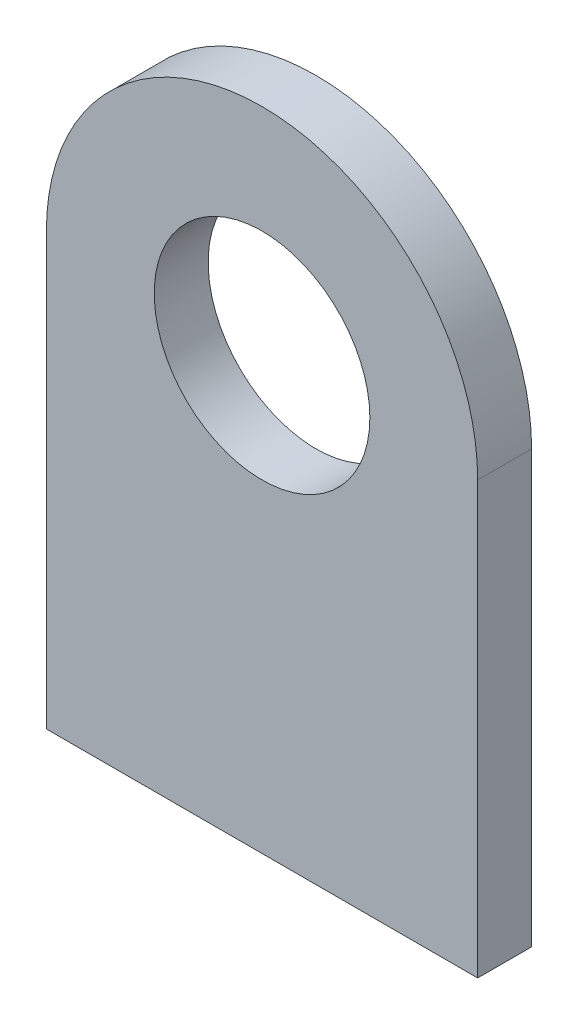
ISO-10303-21;
HEADER;
FILE_DESCRIPTION(('STEP AP214'),'2;1');
FILE_NAME('part.step','',(''),(''),'','','');
FILE_SCHEMA(('AUTOMOTIVE_DESIGN { 1 0 10303 214 1 1 1 1 }'));
ENDSEC;
DATA;
#1=APPLICATION_CONTEXT('core data for automotive mechanical design processes');
#2=APPLICATION_PROTOCOL_DEFINITION('international standard','automotive_design',2000,#1);
#3=PRODUCT_CONTEXT('',#1,'mechanical');
#4=PRODUCT('Part','Part','',(#3));
#5=PRODUCT_RELATED_PRODUCT_CATEGORY('part','',(#4));
#6=PRODUCT_DEFINITION_FORMATION('','',#4);
#7=PRODUCT_DEFINITION_CONTEXT('part definition',#1,'design');
#8=PRODUCT_DEFINITION('design','',#6,#7);
#9=PRODUCT_DEFINITION_SHAPE('','',#8);
#10=(LENGTH_UNIT() NAMED_UNIT(*) SI_UNIT(.MILLI.,.METRE.));
#11=(NAMED_UNIT(*) PLANE_ANGLE_UNIT() SI_UNIT($,.RADIAN.));
#12=(NAMED_UNIT(*) SI_UNIT($,.STERADIAN.) SOLID_ANGLE_UNIT());
#13=UNCERTAINTY_MEASURE_WITH_UNIT(LENGTH_MEASURE(1.E-05),#10,'distance_accuracy_value','');
#14=(GEOMETRIC_REPRESENTATION_CONTEXT(3) GLOBAL_UNCERTAINTY_ASSIGNED_CONTEXT((#13)) GLOBAL_UNIT_ASSIGNED_CONTEXT((#10,
#11,#12)) REPRESENTATION_CONTEXT('',''));
#15=CARTESIAN_POINT('',(0.,0.,0.));
#16=DIRECTION('',(0.,0.,1.));
#17=DIRECTION('',(1.,0.,0.));
#18=AXIS2_PLACEMENT_3D('',#15,#16,#17);
#19=CARTESIAN_POINT('',(-20.,40.,5.));
#20=DIRECTION('',(0.,0.,-1.));
#21=DIRECTION('',(-1.,0.,0.));
#22=AXIS2_PLACEMENT_3D('',#19,#20,#21);
#23=CYLINDRICAL_SURFACE('',#22,20.);
#24=CARTESIAN_POINT('',(-20.,40.,0.));
#25=DIRECTION('',(0.,0.,1.));
#26=DIRECTION('',(-1.,0.,0.));
#27=AXIS2_PLACEMENT_3D('',#24,#25,#26);
#28=CIRCLE('',#27,20.);
#29=CARTESIAN_POINT('',(0.,40.,0.));
#30=VERTEX_POINT('',#29);
#31=CARTESIAN_POINT('',(-40.,40.,0.));
#32=VERTEX_POINT('',#31);
#33=EDGE_CURVE('E93',#30,#32,#28,.T.);
#34=ORIENTED_EDGE('',*,*,#33,.T.);
#35=DIRECTION('',(0.,0.,-1.));
#36=VECTOR('',#35,1.);
#37=CARTESIAN_POINT('',(-40.,40.,5.));
#38=LINE('',#37,#36);
#39=CARTESIAN_POINT('',(-40.,40.,5.));
#40=VERTEX_POINT('',#39);
#41=EDGE_CURVE('E11',#40,#32,#38,.T.);
#42=ORIENTED_EDGE('',*,*,#41,.F.);
#43=CARTESIAN_POINT('',(-20.,40.,5.));
#44=DIRECTION('',(0.,0.,1.));
#45=DIRECTION('',(-1.,0.,0.));
#46=AXIS2_PLACEMENT_3D('',#43,#44,#45);
#47=CIRCLE('',#46,20.);
#48=CARTESIAN_POINT('',(0.,40.,5.));
#49=VERTEX_POINT('',#48);
#50=EDGE_CURVE('E81',#49,#40,#47,.T.);
#51=ORIENTED_EDGE('',*,*,#50,.F.);
#52=DIRECTION('',(0.,0.,-1.));
#53=VECTOR('',#52,1.);
#54=CARTESIAN_POINT('',(0.,40.,5.));
#55=LINE('',#54,#53);
#56=EDGE_CURVE('E89',#49,#30,#55,.T.);
#57=ORIENTED_EDGE('',*,*,#56,.T.);
#58=EDGE_LOOP('',(#34,#42,#51,#57));
#59=FACE_BOUND('',#58,.T.);
#60=ADVANCED_FACE('F30',(#59),#23,.T.);
#61=CARTESIAN_POINT('',(-40.,0.,5.));
#62=DIRECTION('',(1.,0.,0.));
#63=DIRECTION('',(0.,1.,0.));
#64=AXIS2_PLACEMENT_3D('',#61,#62,#63);
#65=PLANE('',#64);
#66=DIRECTION('',(0.,-1.,0.));
#67=VECTOR('',#66,1.);
#68=CARTESIAN_POINT('',(-40.,0.,0.));
#69=LINE('',#68,#67);
#70=CARTESIAN_POINT('',(-40.,0.,0.));
#71=VERTEX_POINT('',#70);
#72=EDGE_CURVE('E85',#32,#71,#69,.T.);
#73=ORIENTED_EDGE('',*,*,#72,.T.);
#74=DIRECTION('',(0.,0.,-1.));
#75=VECTOR('',#74,1.);
#76=CARTESIAN_POINT('',(-40.,0.,5.));
#77=LINE('',#76,#75);
#78=CARTESIAN_POINT('',(-40.,0.,5.));
#79=VERTEX_POINT('',#78);
#80=EDGE_CURVE('E38',#79,#71,#77,.T.);
#81=ORIENTED_EDGE('',*,*,#80,.F.);
#82=DIRECTION('',(0.,-1.,0.));
#83=VECTOR('',#82,1.);
#84=CARTESIAN_POINT('',(-40.,0.,5.));
#85=LINE('',#84,#83);
#86=EDGE_CURVE('E76',#40,#79,#85,.T.);
#87=ORIENTED_EDGE('',*,*,#86,.F.);
#88=ORIENTED_EDGE('',*,*,#41,.T.);
#89=EDGE_LOOP('',(#73,#81,#87,#88));
#90=FACE_BOUND('',#89,.T.);
#91=ADVANCED_FACE('F84',(#90),#65,.F.);
#92=CARTESIAN_POINT('',(0.,0.,5.));
#93=DIRECTION('',(0.,1.,0.));
#94=DIRECTION('',(-1.,0.,0.));
#95=AXIS2_PLACEMENT_3D('',#92,#93,#94);
#96=PLANE('',#95);
#97=DIRECTION('',(1.,0.,0.));
#98=VECTOR('',#97,1.);
#99=CARTESIAN_POINT('',(0.,0.,0.));
#100=LINE('',#99,#98);
#101=CARTESIAN_POINT('',(0.,0.,0.));
#102=VERTEX_POINT('',#101);
#103=EDGE_CURVE('E63',#71,#102,#100,.T.);
#104=ORIENTED_EDGE('',*,*,#103,.T.);
#105=DIRECTION('',(0.,0.,-1.));
#106=VECTOR('',#105,1.);
#107=CARTESIAN_POINT('',(0.,0.,5.));
#108=LINE('',#107,#106);
#109=CARTESIAN_POINT('',(0.,0.,5.));
#110=VERTEX_POINT('',#109);
#111=EDGE_CURVE('E86',#110,#102,#108,.T.);
#112=ORIENTED_EDGE('',*,*,#111,.F.);
#113=DIRECTION('',(1.,0.,0.));
#114=VECTOR('',#113,1.);
#115=CARTESIAN_POINT('',(0.,0.,5.));
#116=LINE('',#115,#114);
#117=EDGE_CURVE('E79',#79,#110,#116,.T.);
#118=ORIENTED_EDGE('',*,*,#117,.F.);
#119=ORIENTED_EDGE('',*,*,#80,.T.);
#120=EDGE_LOOP('',(#104,#112,#118,#119));
#121=FACE_BOUND('',#120,.T.);
#122=ADVANCED_FACE('F87',(#121),#96,.F.);
#123=CARTESIAN_POINT('',(0.,40.,5.));
#124=DIRECTION('',(-1.,0.,0.));
#125=DIRECTION('',(0.,-1.,0.));
#126=AXIS2_PLACEMENT_3D('',#123,#124,#125);
#127=PLANE('',#126);
#128=DIRECTION('',(0.,1.,0.));
#129=VECTOR('',#128,1.);
#130=CARTESIAN_POINT('',(0.,40.,0.));
#131=LINE('',#130,#129);
#132=EDGE_CURVE('E69',#102,#30,#131,.T.);
#133=ORIENTED_EDGE('',*,*,#132,.T.);
#134=ORIENTED_EDGE('',*,*,#56,.F.);
#135=DIRECTION('',(0.,1.,0.));
#136=VECTOR('',#135,1.);
#137=CARTESIAN_POINT('',(0.,40.,5.));
#138=LINE('',#137,#136);
#139=EDGE_CURVE('E46',#110,#49,#138,.T.);
#140=ORIENTED_EDGE('',*,*,#139,.F.);
#141=ORIENTED_EDGE('',*,*,#111,.T.);
#142=EDGE_LOOP('',(#133,#134,#140,#141));
#143=FACE_BOUND('',#142,.T.);
#144=ADVANCED_FACE('F101',(#143),#127,.F.);
#145=CARTESIAN_POINT('',(-20.,40.,5.));
#146=DIRECTION('',(0.,0.,-1.));
#147=DIRECTION('',(-1.,0.,0.));
#148=AXIS2_PLACEMENT_3D('',#145,#146,#147);
#149=PLANE('',#148);
#150=CARTESIAN_POINT('',(-20.,40.,5.));
#151=DIRECTION('',(0.,0.,1.));
#152=DIRECTION('',(1.,0.,0.));
#153=AXIS2_PLACEMENT_3D('',#150,#151,#152);
#154=CIRCLE('',#153,10.);
#155=CARTESIAN_POINT('',(-10.,40.,5.));
#156=VERTEX_POINT('',#155);
#157=EDGE_CURVE('E107',#156,#156,#154,.T.);
#158=ORIENTED_EDGE('',*,*,#157,.F.);
#159=EDGE_LOOP('',(#158));
#160=FACE_BOUND('',#159,.T.);
#161=ORIENTED_EDGE('',*,*,#50,.T.);
#162=ORIENTED_EDGE('',*,*,#86,.T.);
#163=ORIENTED_EDGE('',*,*,#117,.T.);
#164=ORIENTED_EDGE('',*,*,#139,.T.);
#165=EDGE_LOOP('',(#161,#162,#163,#164));
#166=FACE_BOUND('',#165,.T.);
#167=ADVANCED_FACE('F77',(#160,#166),#149,.F.);
#168=CARTESIAN_POINT('',(-20.,40.,0.));
#169=DIRECTION('',(0.,0.,-1.));
#170=DIRECTION('',(-1.,0.,0.));
#171=AXIS2_PLACEMENT_3D('',#168,#169,#170);
#172=PLANE('',#171);
#173=CARTESIAN_POINT('',(-20.,40.,0.));
#174=DIRECTION('',(0.,0.,1.));
#175=DIRECTION('',(1.,0.,0.));
#176=AXIS2_PLACEMENT_3D('',#173,#174,#175);
#177=CIRCLE('',#176,10.);
#178=CARTESIAN_POINT('',(-10.,40.,0.));
#179=VERTEX_POINT('',#178);
#180=EDGE_CURVE('E96',#179,#179,#177,.T.);
#181=ORIENTED_EDGE('',*,*,#180,.T.);
#182=EDGE_LOOP('',(#181));
#183=FACE_BOUND('',#182,.T.);
#184=ORIENTED_EDGE('',*,*,#33,.F.);
#185=ORIENTED_EDGE('',*,*,#132,.F.);
#186=ORIENTED_EDGE('',*,*,#103,.F.);
#187=ORIENTED_EDGE('',*,*,#72,.F.);
#188=EDGE_LOOP('',(#184,#185,#186,#187));
#189=FACE_BOUND('',#188,.T.);
#190=ADVANCED_FACE('F104',(#183,#189),#172,.T.);
#191=CARTESIAN_POINT('',(-20.,40.,0.));
#192=DIRECTION('',(0.,0.,1.));
#193=DIRECTION('',(1.,0.,0.));
#194=AXIS2_PLACEMENT_3D('',#191,#192,#193);
#195=CYLINDRICAL_SURFACE('',#194,10.);
#196=ORIENTED_EDGE('',*,*,#180,.F.);
#197=EDGE_LOOP('',(#196));
#198=FACE_BOUND('',#197,.T.);
#199=ORIENTED_EDGE('',*,*,#157,.T.);
#200=EDGE_LOOP('',(#199));
#201=FACE_BOUND('',#200,.T.);
#202=ADVANCED_FACE('F114',(#198,#201),#195,.F.);
#203=CLOSED_SHELL('',(#60,#91,#122,#144,#167,#190,#202));
#204=MANIFOLD_SOLID_BREP('B2',#203);
#205=ADVANCED_BREP_SHAPE_REPRESENTATION('',(#18,#204),#14);
#206=SHAPE_DEFINITION_REPRESENTATION(#9,#205);
ENDSEC;
END-ISO-10303-21;
